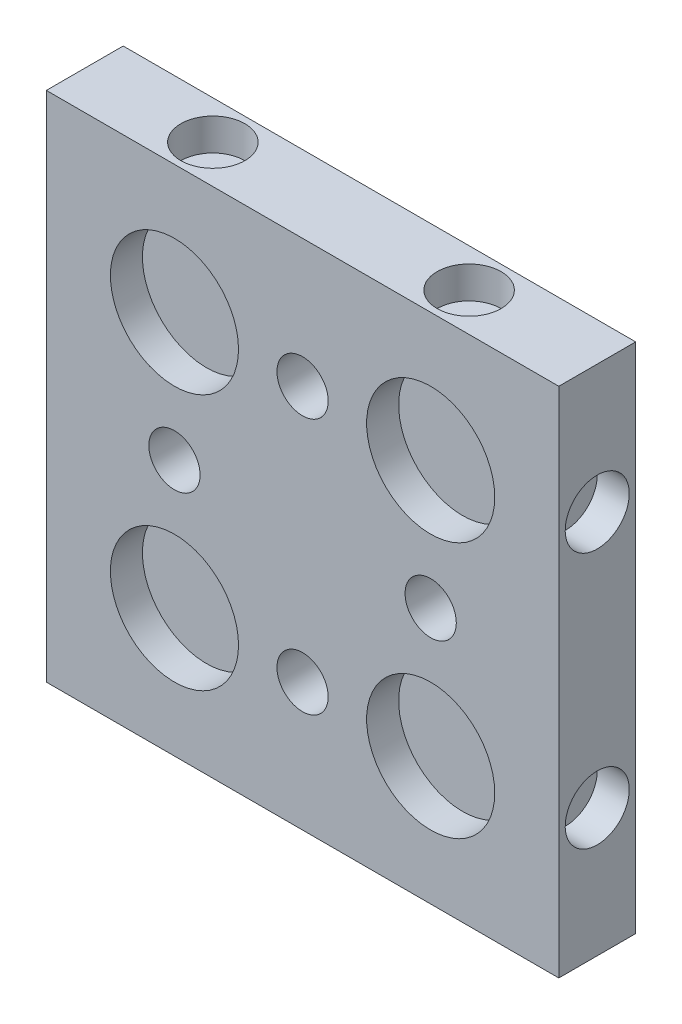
ISO-10303-21;
HEADER;
FILE_DESCRIPTION(('STEP AP214'),'2;1');
FILE_NAME('part.step','',(''),(''),'','','');
FILE_SCHEMA(('AUTOMOTIVE_DESIGN { 1 0 10303 214 1 1 1 1 }'));
ENDSEC;
DATA;
#1=APPLICATION_CONTEXT('core data for automotive mechanical design processes');
#2=APPLICATION_PROTOCOL_DEFINITION('international standard','automotive_design',2000,#1);
#3=PRODUCT_CONTEXT('',#1,'mechanical');
#4=PRODUCT('Part','Part','',(#3));
#5=PRODUCT_RELATED_PRODUCT_CATEGORY('part','',(#4));
#6=PRODUCT_DEFINITION_FORMATION('','',#4);
#7=PRODUCT_DEFINITION_CONTEXT('part definition',#1,'design');
#8=PRODUCT_DEFINITION('design','',#6,#7);
#9=PRODUCT_DEFINITION_SHAPE('','',#8);
#10=(LENGTH_UNIT() NAMED_UNIT(*) SI_UNIT(.MILLI.,.METRE.));
#11=(NAMED_UNIT(*) PLANE_ANGLE_UNIT() SI_UNIT($,.RADIAN.));
#12=(NAMED_UNIT(*) SI_UNIT($,.STERADIAN.) SOLID_ANGLE_UNIT());
#13=UNCERTAINTY_MEASURE_WITH_UNIT(LENGTH_MEASURE(1.E-05),#10,'distance_accuracy_value','');
#14=(GEOMETRIC_REPRESENTATION_CONTEXT(3) GLOBAL_UNCERTAINTY_ASSIGNED_CONTEXT((#13)) GLOBAL_UNIT_ASSIGNED_CONTEXT((#10,
#11,#12)) REPRESENTATION_CONTEXT('',''));
#15=CARTESIAN_POINT('',(0.,0.,0.));
#16=DIRECTION('',(0.,0.,1.));
#17=DIRECTION('',(1.,0.,0.));
#18=AXIS2_PLACEMENT_3D('',#15,#16,#17);
#19=CARTESIAN_POINT('',(-21.3507246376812,25.9521739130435,7.62));
#20=DIRECTION('',(1.,0.,0.));
#21=DIRECTION('',(0.,1.,0.));
#22=AXIS2_PLACEMENT_3D('',#19,#20,#21);
#23=PLANE('',#22);
#24=CARTESIAN_POINT('',(-21.3507246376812,13.2521739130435,3.81));
#25=DIRECTION('',(-1.,0.,0.));
#26=DIRECTION('',(0.,-1.,0.));
#27=AXIS2_PLACEMENT_3D('',#24,#25,#26);
#28=CIRCLE('',#27,3.175);
#29=CARTESIAN_POINT('',(-21.3507246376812,10.0771739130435,3.81));
#30=VERTEX_POINT('',#29);
#31=EDGE_CURVE('E239',#30,#30,#28,.T.);
#32=ORIENTED_EDGE('',*,*,#31,.F.);
#33=EDGE_LOOP('',(#32));
#34=FACE_BOUND('',#33,.T.);
#35=CARTESIAN_POINT('',(-21.3507246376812,-12.1478260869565,3.81));
#36=DIRECTION('',(-1.,0.,0.));
#37=DIRECTION('',(0.,-1.,0.));
#38=AXIS2_PLACEMENT_3D('',#35,#36,#37);
#39=CIRCLE('',#38,3.175);
#40=CARTESIAN_POINT('',(-21.3507246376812,-15.3228260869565,3.81));
#41=VERTEX_POINT('',#40);
#42=EDGE_CURVE('E234',#41,#41,#39,.T.);
#43=ORIENTED_EDGE('',*,*,#42,.F.);
#44=EDGE_LOOP('',(#43));
#45=FACE_BOUND('',#44,.T.);
#46=DIRECTION('',(0.,-1.,0.));
#47=VECTOR('',#46,1.);
#48=CARTESIAN_POINT('',(-21.3507246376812,25.9521739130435,0.));
#49=LINE('',#48,#47);
#50=CARTESIAN_POINT('',(-21.3507246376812,25.9521739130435,0.));
#51=VERTEX_POINT('',#50);
#52=CARTESIAN_POINT('',(-21.3507246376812,-24.8478260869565,0.));
#53=VERTEX_POINT('',#52);
#54=EDGE_CURVE('E113',#51,#53,#49,.T.);
#55=ORIENTED_EDGE('',*,*,#54,.T.);
#56=DIRECTION('',(0.,0.,-1.));
#57=VECTOR('',#56,1.);
#58=CARTESIAN_POINT('',(-21.3507246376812,-24.8478260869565,7.62));
#59=LINE('',#58,#57);
#60=CARTESIAN_POINT('',(-21.3507246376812,-24.8478260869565,7.62));
#61=VERTEX_POINT('',#60);
#62=EDGE_CURVE('E11',#61,#53,#59,.T.);
#63=ORIENTED_EDGE('',*,*,#62,.F.);
#64=DIRECTION('',(0.,-1.,0.));
#65=VECTOR('',#64,1.);
#66=CARTESIAN_POINT('',(-21.3507246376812,25.9521739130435,7.62));
#67=LINE('',#66,#65);
#68=CARTESIAN_POINT('',(-21.3507246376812,25.9521739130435,7.62));
#69=VERTEX_POINT('',#68);
#70=EDGE_CURVE('E97',#69,#61,#67,.T.);
#71=ORIENTED_EDGE('',*,*,#70,.F.);
#72=DIRECTION('',(0.,0.,-1.));
#73=VECTOR('',#72,1.);
#74=CARTESIAN_POINT('',(-21.3507246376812,25.9521739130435,7.62));
#75=LINE('',#74,#73);
#76=EDGE_CURVE('E109',#69,#51,#75,.T.);
#77=ORIENTED_EDGE('',*,*,#76,.T.);
#78=EDGE_LOOP('',(#55,#63,#71,#77));
#79=FACE_BOUND('',#78,.T.);
#80=ADVANCED_FACE('F45',(#34,#45,#79),#23,.F.);
#81=CARTESIAN_POINT('',(-21.3507246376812,-24.8478260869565,7.62));
#82=DIRECTION('',(0.,1.,0.));
#83=DIRECTION('',(0.,0.,1.));
#84=AXIS2_PLACEMENT_3D('',#81,#82,#83);
#85=PLANE('',#84);
#86=CARTESIAN_POINT('',(-8.65072463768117,-24.8478260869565,3.81));
#87=DIRECTION('',(0.,-1.,0.));
#88=DIRECTION('',(0.,0.,-1.));
#89=AXIS2_PLACEMENT_3D('',#86,#87,#88);
#90=CIRCLE('',#89,3.175);
#91=CARTESIAN_POINT('',(-8.65072463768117,-24.8478260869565,0.634999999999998));
#92=VERTEX_POINT('',#91);
#93=EDGE_CURVE('E223',#92,#92,#90,.T.);
#94=ORIENTED_EDGE('',*,*,#93,.F.);
#95=EDGE_LOOP('',(#94));
#96=FACE_BOUND('',#95,.T.);
#97=CARTESIAN_POINT('',(16.7492753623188,-24.8478260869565,3.81));
#98=DIRECTION('',(0.,-1.,0.));
#99=DIRECTION('',(0.,0.,-1.));
#100=AXIS2_PLACEMENT_3D('',#97,#98,#99);
#101=CIRCLE('',#100,3.175);
#102=CARTESIAN_POINT('',(16.7492753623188,-24.8478260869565,0.634999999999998));
#103=VERTEX_POINT('',#102);
#104=EDGE_CURVE('E218',#103,#103,#101,.T.);
#105=ORIENTED_EDGE('',*,*,#104,.F.);
#106=EDGE_LOOP('',(#105));
#107=FACE_BOUND('',#106,.T.);
#108=DIRECTION('',(1.,0.,0.));
#109=VECTOR('',#108,1.);
#110=CARTESIAN_POINT('',(-21.3507246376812,-24.8478260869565,0.));
#111=LINE('',#110,#109);
#112=CARTESIAN_POINT('',(29.4492753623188,-24.8478260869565,0.));
#113=VERTEX_POINT('',#112);
#114=EDGE_CURVE('E102',#53,#113,#111,.T.);
#115=ORIENTED_EDGE('',*,*,#114,.T.);
#116=DIRECTION('',(0.,0.,-1.));
#117=VECTOR('',#116,1.);
#118=CARTESIAN_POINT('',(29.4492753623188,-24.8478260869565,7.62));
#119=LINE('',#118,#117);
#120=CARTESIAN_POINT('',(29.4492753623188,-24.8478260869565,7.62));
#121=VERTEX_POINT('',#120);
#122=EDGE_CURVE('E54',#121,#113,#119,.T.);
#123=ORIENTED_EDGE('',*,*,#122,.F.);
#124=DIRECTION('',(1.,0.,0.));
#125=VECTOR('',#124,1.);
#126=CARTESIAN_POINT('',(-21.3507246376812,-24.8478260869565,7.62));
#127=LINE('',#126,#125);
#128=EDGE_CURVE('E92',#61,#121,#127,.T.);
#129=ORIENTED_EDGE('',*,*,#128,.F.);
#130=ORIENTED_EDGE('',*,*,#62,.T.);
#131=EDGE_LOOP('',(#115,#123,#129,#130));
#132=FACE_BOUND('',#131,.T.);
#133=ADVANCED_FACE('F101',(#96,#107,#132),#85,.F.);
#134=CARTESIAN_POINT('',(29.4492753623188,25.9521739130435,7.62));
#135=DIRECTION('',(-1.,0.,0.));
#136=DIRECTION('',(0.,-1.,0.));
#137=AXIS2_PLACEMENT_3D('',#134,#135,#136);
#138=PLANE('',#137);
#139=CARTESIAN_POINT('',(29.4492753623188,13.2521739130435,3.81));
#140=DIRECTION('',(1.,0.,0.));
#141=DIRECTION('',(0.,1.,0.));
#142=AXIS2_PLACEMENT_3D('',#139,#140,#141);
#143=CIRCLE('',#142,3.175);
#144=CARTESIAN_POINT('',(29.4492753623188,16.4271739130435,3.81));
#145=VERTEX_POINT('',#144);
#146=EDGE_CURVE('E207',#145,#145,#143,.T.);
#147=ORIENTED_EDGE('',*,*,#146,.F.);
#148=EDGE_LOOP('',(#147));
#149=FACE_BOUND('',#148,.T.);
#150=CARTESIAN_POINT('',(29.4492753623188,-12.1478260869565,3.81));
#151=DIRECTION('',(1.,0.,0.));
#152=DIRECTION('',(0.,1.,0.));
#153=AXIS2_PLACEMENT_3D('',#150,#151,#152);
#154=CIRCLE('',#153,3.175);
#155=CARTESIAN_POINT('',(29.4492753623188,-8.97282608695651,3.81));
#156=VERTEX_POINT('',#155);
#157=EDGE_CURVE('E202',#156,#156,#154,.T.);
#158=ORIENTED_EDGE('',*,*,#157,.F.);
#159=EDGE_LOOP('',(#158));
#160=FACE_BOUND('',#159,.T.);
#161=DIRECTION('',(0.,1.,0.));
#162=VECTOR('',#161,1.);
#163=CARTESIAN_POINT('',(29.4492753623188,25.9521739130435,0.));
#164=LINE('',#163,#162);
#165=CARTESIAN_POINT('',(29.4492753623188,25.9521739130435,0.));
#166=VERTEX_POINT('',#165);
#167=EDGE_CURVE('E79',#113,#166,#164,.T.);
#168=ORIENTED_EDGE('',*,*,#167,.T.);
#169=DIRECTION('',(0.,0.,-1.));
#170=VECTOR('',#169,1.);
#171=CARTESIAN_POINT('',(29.4492753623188,25.9521739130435,7.62));
#172=LINE('',#171,#170);
#173=CARTESIAN_POINT('',(29.4492753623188,25.9521739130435,7.62));
#174=VERTEX_POINT('',#173);
#175=EDGE_CURVE('E104',#174,#166,#172,.T.);
#176=ORIENTED_EDGE('',*,*,#175,.F.);
#177=DIRECTION('',(0.,1.,0.));
#178=VECTOR('',#177,1.);
#179=CARTESIAN_POINT('',(29.4492753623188,25.9521739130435,7.62));
#180=LINE('',#179,#178);
#181=EDGE_CURVE('E95',#121,#174,#180,.T.);
#182=ORIENTED_EDGE('',*,*,#181,.F.);
#183=ORIENTED_EDGE('',*,*,#122,.T.);
#184=EDGE_LOOP('',(#168,#176,#182,#183));
#185=FACE_BOUND('',#184,.T.);
#186=ADVANCED_FACE('F105',(#149,#160,#185),#138,.F.);
#187=CARTESIAN_POINT('',(-21.3507246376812,25.9521739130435,7.62));
#188=DIRECTION('',(0.,-1.,0.));
#189=DIRECTION('',(0.,0.,-1.));
#190=AXIS2_PLACEMENT_3D('',#187,#188,#189);
#191=PLANE('',#190);
#192=CARTESIAN_POINT('',(-8.65072463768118,25.9521739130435,3.81));
#193=DIRECTION('',(0.,1.,0.));
#194=DIRECTION('',(0.,0.,1.));
#195=AXIS2_PLACEMENT_3D('',#192,#193,#194);
#196=CIRCLE('',#195,3.175);
#197=CARTESIAN_POINT('',(-8.65072463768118,25.9521739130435,6.985));
#198=VERTEX_POINT('',#197);
#199=EDGE_CURVE('E254',#198,#198,#196,.T.);
#200=ORIENTED_EDGE('',*,*,#199,.F.);
#201=EDGE_LOOP('',(#200));
#202=FACE_BOUND('',#201,.T.);
#203=CARTESIAN_POINT('',(16.7492753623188,25.9521739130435,3.81));
#204=DIRECTION('',(0.,1.,0.));
#205=DIRECTION('',(0.,0.,1.));
#206=AXIS2_PLACEMENT_3D('',#203,#204,#205);
#207=CIRCLE('',#206,3.175);
#208=CARTESIAN_POINT('',(16.7492753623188,25.9521739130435,6.985));
#209=VERTEX_POINT('',#208);
#210=EDGE_CURVE('E250',#209,#209,#207,.T.);
#211=ORIENTED_EDGE('',*,*,#210,.F.);
#212=EDGE_LOOP('',(#211));
#213=FACE_BOUND('',#212,.T.);
#214=DIRECTION('',(-1.,0.,0.));
#215=VECTOR('',#214,1.);
#216=CARTESIAN_POINT('',(-21.3507246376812,25.9521739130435,0.));
#217=LINE('',#216,#215);
#218=EDGE_CURVE('E85',#166,#51,#217,.T.);
#219=ORIENTED_EDGE('',*,*,#218,.T.);
#220=ORIENTED_EDGE('',*,*,#76,.F.);
#221=DIRECTION('',(-1.,0.,0.));
#222=VECTOR('',#221,1.);
#223=CARTESIAN_POINT('',(-21.3507246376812,25.9521739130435,7.62));
#224=LINE('',#223,#222);
#225=EDGE_CURVE('E62',#174,#69,#224,.T.);
#226=ORIENTED_EDGE('',*,*,#225,.F.);
#227=ORIENTED_EDGE('',*,*,#175,.T.);
#228=EDGE_LOOP('',(#219,#220,#226,#227));
#229=FACE_BOUND('',#228,.T.);
#230=ADVANCED_FACE('F127',(#202,#213,#229),#191,.F.);
#231=CARTESIAN_POINT('',(0.,0.,7.62));
#232=DIRECTION('',(0.,0.,1.));
#233=DIRECTION('',(1.,0.,0.));
#234=AXIS2_PLACEMENT_3D('',#231,#232,#233);
#235=PLANE('',#234);
#236=CARTESIAN_POINT('',(-8.65072463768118,-12.1478260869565,7.62));
#237=DIRECTION('',(0.,0.,1.));
#238=DIRECTION('',(1.,0.,0.));
#239=AXIS2_PLACEMENT_3D('',#236,#237,#238);
#240=CIRCLE('',#239,6.35);
#241=CARTESIAN_POINT('',(-2.30072463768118,-12.1478260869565,7.62));
#242=VERTEX_POINT('',#241);
#243=EDGE_CURVE('E178',#242,#242,#240,.T.);
#244=ORIENTED_EDGE('',*,*,#243,.F.);
#245=EDGE_LOOP('',(#244));
#246=FACE_BOUND('',#245,.T.);
#247=CARTESIAN_POINT('',(16.7492753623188,-12.1478260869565,7.62));
#248=DIRECTION('',(0.,0.,1.));
#249=DIRECTION('',(1.,0.,0.));
#250=AXIS2_PLACEMENT_3D('',#247,#248,#249);
#251=CIRCLE('',#250,6.35);
#252=CARTESIAN_POINT('',(23.0992753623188,-12.1478260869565,7.62));
#253=VERTEX_POINT('',#252);
#254=EDGE_CURVE('E187',#253,#253,#251,.T.);
#255=ORIENTED_EDGE('',*,*,#254,.F.);
#256=EDGE_LOOP('',(#255));
#257=FACE_BOUND('',#256,.T.);
#258=CARTESIAN_POINT('',(16.7492753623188,13.2521739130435,7.62));
#259=DIRECTION('',(0.,0.,1.));
#260=DIRECTION('',(1.,0.,0.));
#261=AXIS2_PLACEMENT_3D('',#258,#259,#260);
#262=CIRCLE('',#261,6.35);
#263=CARTESIAN_POINT('',(23.0992753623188,13.2521739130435,7.62));
#264=VERTEX_POINT('',#263);
#265=EDGE_CURVE('E170',#264,#264,#262,.T.);
#266=ORIENTED_EDGE('',*,*,#265,.F.);
#267=EDGE_LOOP('',(#266));
#268=FACE_BOUND('',#267,.T.);
#269=CARTESIAN_POINT('',(-8.65072463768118,13.2521739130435,7.62));
#270=DIRECTION('',(0.,0.,1.));
#271=DIRECTION('',(1.,0.,0.));
#272=AXIS2_PLACEMENT_3D('',#269,#270,#271);
#273=CIRCLE('',#272,6.35);
#274=CARTESIAN_POINT('',(-2.30072463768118,13.2521739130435,7.62));
#275=VERTEX_POINT('',#274);
#276=EDGE_CURVE('E166',#275,#275,#273,.T.);
#277=ORIENTED_EDGE('',*,*,#276,.F.);
#278=EDGE_LOOP('',(#277));
#279=FACE_BOUND('',#278,.T.);
#280=CARTESIAN_POINT('',(-8.65072463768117,0.552173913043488,7.62));
#281=DIRECTION('',(0.,0.,1.));
#282=DIRECTION('',(1.,0.,0.));
#283=AXIS2_PLACEMENT_3D('',#280,#281,#282);
#284=CIRCLE('',#283,2.54);
#285=CARTESIAN_POINT('',(-6.11072463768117,0.552173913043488,7.62));
#286=VERTEX_POINT('',#285);
#287=EDGE_CURVE('E159',#286,#286,#284,.T.);
#288=ORIENTED_EDGE('',*,*,#287,.F.);
#289=EDGE_LOOP('',(#288));
#290=FACE_BOUND('',#289,.T.);
#291=CARTESIAN_POINT('',(4.04927536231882,13.2521739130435,7.62));
#292=DIRECTION('',(0.,0.,1.));
#293=DIRECTION('',(1.,0.,0.));
#294=AXIS2_PLACEMENT_3D('',#291,#292,#293);
#295=CIRCLE('',#294,2.54);
#296=CARTESIAN_POINT('',(6.58927536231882,13.2521739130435,7.62));
#297=VERTEX_POINT('',#296);
#298=EDGE_CURVE('E155',#297,#297,#295,.T.);
#299=ORIENTED_EDGE('',*,*,#298,.F.);
#300=EDGE_LOOP('',(#299));
#301=FACE_BOUND('',#300,.T.);
#302=CARTESIAN_POINT('',(4.04927536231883,-12.1478260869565,7.62));
#303=DIRECTION('',(0.,0.,1.));
#304=DIRECTION('',(1.,0.,0.));
#305=AXIS2_PLACEMENT_3D('',#302,#303,#304);
#306=CIRCLE('',#305,2.54);
#307=CARTESIAN_POINT('',(6.58927536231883,-12.1478260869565,7.62));
#308=VERTEX_POINT('',#307);
#309=EDGE_CURVE('E147',#308,#308,#306,.T.);
#310=ORIENTED_EDGE('',*,*,#309,.F.);
#311=EDGE_LOOP('',(#310));
#312=FACE_BOUND('',#311,.T.);
#313=CARTESIAN_POINT('',(16.7492753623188,0.552173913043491,7.62));
#314=DIRECTION('',(0.,0.,1.));
#315=DIRECTION('',(1.,0.,0.));
#316=AXIS2_PLACEMENT_3D('',#313,#314,#315);
#317=CIRCLE('',#316,2.54);
#318=CARTESIAN_POINT('',(19.2892753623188,0.552173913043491,7.62));
#319=VERTEX_POINT('',#318);
#320=EDGE_CURVE('E138',#319,#319,#317,.T.);
#321=ORIENTED_EDGE('',*,*,#320,.F.);
#322=EDGE_LOOP('',(#321));
#323=FACE_BOUND('',#322,.T.);
#324=ORIENTED_EDGE('',*,*,#70,.T.);
#325=ORIENTED_EDGE('',*,*,#128,.T.);
#326=ORIENTED_EDGE('',*,*,#181,.T.);
#327=ORIENTED_EDGE('',*,*,#225,.T.);
#328=EDGE_LOOP('',(#324,#325,#326,#327));
#329=FACE_BOUND('',#328,.T.);
#330=ADVANCED_FACE('F93',(#246,#257,#268,#279,#290,#301,#312,#323,#329),#235,.T.);
#331=CARTESIAN_POINT('',(0.,0.,0.));
#332=DIRECTION('',(0.,0.,1.));
#333=DIRECTION('',(1.,0.,0.));
#334=AXIS2_PLACEMENT_3D('',#331,#332,#333);
#335=PLANE('',#334);
#336=CARTESIAN_POINT('',(-8.65072463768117,0.552173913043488,0.));
#337=DIRECTION('',(0.,0.,1.));
#338=DIRECTION('',(1.,0.,0.));
#339=AXIS2_PLACEMENT_3D('',#336,#337,#338);
#340=CIRCLE('',#339,2.54);
#341=CARTESIAN_POINT('',(-6.11072463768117,0.552173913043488,0.));
#342=VERTEX_POINT('',#341);
#343=EDGE_CURVE('E117',#342,#342,#340,.T.);
#344=ORIENTED_EDGE('',*,*,#343,.T.);
#345=EDGE_LOOP('',(#344));
#346=FACE_BOUND('',#345,.T.);
#347=CARTESIAN_POINT('',(4.04927536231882,13.2521739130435,0.));
#348=DIRECTION('',(0.,0.,1.));
#349=DIRECTION('',(1.,0.,0.));
#350=AXIS2_PLACEMENT_3D('',#347,#348,#349);
#351=CIRCLE('',#350,2.54);
#352=CARTESIAN_POINT('',(6.58927536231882,13.2521739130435,0.));
#353=VERTEX_POINT('',#352);
#354=EDGE_CURVE('E151',#353,#353,#351,.T.);
#355=ORIENTED_EDGE('',*,*,#354,.T.);
#356=EDGE_LOOP('',(#355));
#357=FACE_BOUND('',#356,.T.);
#358=CARTESIAN_POINT('',(4.04927536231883,-12.1478260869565,0.));
#359=DIRECTION('',(0.,0.,1.));
#360=DIRECTION('',(1.,0.,0.));
#361=AXIS2_PLACEMENT_3D('',#358,#359,#360);
#362=CIRCLE('',#361,2.54);
#363=CARTESIAN_POINT('',(6.58927536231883,-12.1478260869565,0.));
#364=VERTEX_POINT('',#363);
#365=EDGE_CURVE('E143',#364,#364,#362,.T.);
#366=ORIENTED_EDGE('',*,*,#365,.T.);
#367=EDGE_LOOP('',(#366));
#368=FACE_BOUND('',#367,.T.);
#369=CARTESIAN_POINT('',(16.7492753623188,0.552173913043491,0.));
#370=DIRECTION('',(0.,0.,1.));
#371=DIRECTION('',(1.,0.,0.));
#372=AXIS2_PLACEMENT_3D('',#369,#370,#371);
#373=CIRCLE('',#372,2.54);
#374=CARTESIAN_POINT('',(19.2892753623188,0.552173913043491,0.));
#375=VERTEX_POINT('',#374);
#376=EDGE_CURVE('E134',#375,#375,#373,.T.);
#377=ORIENTED_EDGE('',*,*,#376,.T.);
#378=EDGE_LOOP('',(#377));
#379=FACE_BOUND('',#378,.T.);
#380=ORIENTED_EDGE('',*,*,#54,.F.);
#381=ORIENTED_EDGE('',*,*,#218,.F.);
#382=ORIENTED_EDGE('',*,*,#167,.F.);
#383=ORIENTED_EDGE('',*,*,#114,.F.);
#384=EDGE_LOOP('',(#380,#381,#382,#383));
#385=FACE_BOUND('',#384,.T.);
#386=ADVANCED_FACE('F130',(#346,#357,#368,#379,#385),#335,.F.);
#387=CARTESIAN_POINT('',(16.7492753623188,0.552173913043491,0.));
#388=DIRECTION('',(0.,0.,1.));
#389=DIRECTION('',(1.,0.,0.));
#390=AXIS2_PLACEMENT_3D('',#387,#388,#389);
#391=CYLINDRICAL_SURFACE('',#390,2.54);
#392=CARTESIAN_POINT('',(19.2892753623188,0.552173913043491,0.));
#393=CARTESIAN_POINT('',(19.2892753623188,0.552173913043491,0.0793749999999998));
#394=CARTESIAN_POINT('',(19.2892753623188,0.552173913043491,0.15875));
#395=CARTESIAN_POINT('',(19.2892753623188,0.552173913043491,0.3175));
#396=CARTESIAN_POINT('',(19.2892753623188,0.552173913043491,0.396875));
#397=CARTESIAN_POINT('',(19.2892753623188,0.552173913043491,0.555625));
#398=CARTESIAN_POINT('',(19.2892753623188,0.552173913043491,0.635));
#399=CARTESIAN_POINT('',(19.2892753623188,0.552173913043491,0.79375));
#400=CARTESIAN_POINT('',(19.2892753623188,0.552173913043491,0.873125));
#401=CARTESIAN_POINT('',(19.2892753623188,0.552173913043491,1.031875));
#402=CARTESIAN_POINT('',(19.2892753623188,0.552173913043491,1.11125));
#403=CARTESIAN_POINT('',(19.2892753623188,0.552173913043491,1.27));
#404=CARTESIAN_POINT('',(19.2892753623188,0.552173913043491,1.349375));
#405=CARTESIAN_POINT('',(19.2892753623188,0.552173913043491,1.508125));
#406=CARTESIAN_POINT('',(19.2892753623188,0.552173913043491,1.5875));
#407=CARTESIAN_POINT('',(19.2892753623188,0.552173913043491,1.74625));
#408=CARTESIAN_POINT('',(19.2892753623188,0.552173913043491,1.825625));
#409=CARTESIAN_POINT('',(19.2892753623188,0.552173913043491,1.984375));
#410=CARTESIAN_POINT('',(19.2892753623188,0.552173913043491,2.06375));
#411=CARTESIAN_POINT('',(19.2892753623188,0.552173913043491,2.2225));
#412=CARTESIAN_POINT('',(19.2892753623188,0.552173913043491,2.301875));
#413=CARTESIAN_POINT('',(19.2892753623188,0.552173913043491,2.460625));
#414=CARTESIAN_POINT('',(19.2892753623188,0.552173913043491,2.54));
#415=CARTESIAN_POINT('',(19.2892753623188,0.552173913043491,2.69875));
#416=CARTESIAN_POINT('',(19.2892753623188,0.552173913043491,2.778125));
#417=CARTESIAN_POINT('',(19.2892753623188,0.552173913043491,2.936875));
#418=CARTESIAN_POINT('',(19.2892753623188,0.552173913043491,3.01625));
#419=CARTESIAN_POINT('',(19.2892753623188,0.552173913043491,3.175));
#420=CARTESIAN_POINT('',(19.2892753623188,0.552173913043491,3.254375));
#421=CARTESIAN_POINT('',(19.2892753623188,0.552173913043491,3.413125));
#422=CARTESIAN_POINT('',(19.2892753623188,0.552173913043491,3.4925));
#423=CARTESIAN_POINT('',(19.2892753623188,0.552173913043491,3.65125));
#424=CARTESIAN_POINT('',(19.2892753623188,0.552173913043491,3.730625));
#425=CARTESIAN_POINT('',(19.2892753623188,0.552173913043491,3.889375));
#426=CARTESIAN_POINT('',(19.2892753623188,0.552173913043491,3.96875));
#427=CARTESIAN_POINT('',(19.2892753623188,0.552173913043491,4.1275));
#428=CARTESIAN_POINT('',(19.2892753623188,0.552173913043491,4.206875));
#429=CARTESIAN_POINT('',(19.2892753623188,0.552173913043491,4.365625));
#430=CARTESIAN_POINT('',(19.2892753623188,0.552173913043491,4.445));
#431=CARTESIAN_POINT('',(19.2892753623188,0.552173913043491,4.60375));
#432=CARTESIAN_POINT('',(19.2892753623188,0.552173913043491,4.683125));
#433=CARTESIAN_POINT('',(19.2892753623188,0.552173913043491,4.841875));
#434=CARTESIAN_POINT('',(19.2892753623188,0.552173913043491,4.92125));
#435=CARTESIAN_POINT('',(19.2892753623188,0.552173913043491,5.08));
#436=CARTESIAN_POINT('',(19.2892753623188,0.552173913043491,5.159375));
#437=CARTESIAN_POINT('',(19.2892753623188,0.552173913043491,5.318125));
#438=CARTESIAN_POINT('',(19.2892753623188,0.552173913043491,5.3975));
#439=CARTESIAN_POINT('',(19.2892753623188,0.552173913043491,5.55625));
#440=CARTESIAN_POINT('',(19.2892753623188,0.552173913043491,5.635625));
#441=CARTESIAN_POINT('',(19.2892753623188,0.552173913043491,5.794375));
#442=CARTESIAN_POINT('',(19.2892753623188,0.552173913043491,5.87375));
#443=CARTESIAN_POINT('',(19.2892753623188,0.552173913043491,6.0325));
#444=CARTESIAN_POINT('',(19.2892753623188,0.552173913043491,6.111875));
#445=CARTESIAN_POINT('',(19.2892753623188,0.552173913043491,6.270625));
#446=CARTESIAN_POINT('',(19.2892753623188,0.552173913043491,6.35));
#447=CARTESIAN_POINT('',(19.2892753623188,0.552173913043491,6.50875));
#448=CARTESIAN_POINT('',(19.2892753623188,0.552173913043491,6.588125));
#449=CARTESIAN_POINT('',(19.2892753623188,0.552173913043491,6.746875));
#450=CARTESIAN_POINT('',(19.2892753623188,0.552173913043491,6.82625));
#451=CARTESIAN_POINT('',(19.2892753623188,0.552173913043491,6.985));
#452=CARTESIAN_POINT('',(19.2892753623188,0.552173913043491,7.064375));
#453=CARTESIAN_POINT('',(19.2892753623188,0.552173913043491,7.223125));
#454=CARTESIAN_POINT('',(19.2892753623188,0.552173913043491,7.3025));
#455=CARTESIAN_POINT('',(19.2892753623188,0.552173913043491,7.46125));
#456=CARTESIAN_POINT('',(19.2892753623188,0.552173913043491,7.540625));
#457=CARTESIAN_POINT('',(19.2892753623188,0.552173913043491,7.62));
#458=B_SPLINE_CURVE_WITH_KNOTS('',3,(#392,#393,#394,#395,#396,#397,#398,#399,#400,#401,#402,
#403,#404,#405,#406,#407,#408,#409,#410,#411,#412,#413,#414,#415,#416,#417,#418,#419,#420,#421,
#422,#423,#424,#425,#426,#427,#428,#429,#430,#431,#432,#433,#434,#435,#436,#437,#438,#439,#440,
#441,#442,#443,#444,#445,#446,#447,#448,#449,#450,#451,#452,#453,#454,#455,#456,#457),
.UNSPECIFIED.,.F.,.F.,(4,2,2,2,2,2,2,2,2,2,2,2,2,2,2,2,2,2,2,2,2,2,2,2,2,2,2,2,2,2,2,2,4),(0.,
0.238125,0.47625,0.714375,0.9525,1.190625,1.42875,1.666875,1.905,2.143125,2.38125,2.619375,
2.8575,3.095625,3.33375,3.571875,3.81,4.048125,4.28625,4.524375,4.7625,5.000625,5.23875,
5.476875,5.715,5.953125,6.19125,6.429375,6.6675,6.905625,7.14375,7.381875,7.62),.UNSPECIFIED.);
#459=EDGE_CURVE('BSEAM389',#375,#319,#458,.T.);
#460=ORIENTED_EDGE('',*,*,#376,.F.);
#461=ORIENTED_EDGE('',*,*,#320,.T.);
#462=ORIENTED_EDGE('',*,*,#459,.T.);
#463=ORIENTED_EDGE('',*,*,#459,.F.);
#464=EDGE_LOOP('',(#460,#462,#461,#463));
#465=FACE_BOUND('',#464,.T.);
#466=ADVANCED_FACE('F389',(#465),#391,.F.);
#467=CARTESIAN_POINT('',(4.04927536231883,-12.1478260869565,0.));
#468=DIRECTION('',(0.,0.,1.));
#469=DIRECTION('',(1.,0.,0.));
#470=AXIS2_PLACEMENT_3D('',#467,#468,#469);
#471=CYLINDRICAL_SURFACE('',#470,2.54);
#472=CARTESIAN_POINT('',(6.58927536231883,-12.1478260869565,0.));
#473=CARTESIAN_POINT('',(6.58927536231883,-12.1478260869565,0.0793749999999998));
#474=CARTESIAN_POINT('',(6.58927536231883,-12.1478260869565,0.15875));
#475=CARTESIAN_POINT('',(6.58927536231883,-12.1478260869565,0.3175));
#476=CARTESIAN_POINT('',(6.58927536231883,-12.1478260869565,0.396875));
#477=CARTESIAN_POINT('',(6.58927536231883,-12.1478260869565,0.555625));
#478=CARTESIAN_POINT('',(6.58927536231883,-12.1478260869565,0.635));
#479=CARTESIAN_POINT('',(6.58927536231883,-12.1478260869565,0.79375));
#480=CARTESIAN_POINT('',(6.58927536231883,-12.1478260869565,0.873125));
#481=CARTESIAN_POINT('',(6.58927536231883,-12.1478260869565,1.031875));
#482=CARTESIAN_POINT('',(6.58927536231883,-12.1478260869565,1.11125));
#483=CARTESIAN_POINT('',(6.58927536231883,-12.1478260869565,1.27));
#484=CARTESIAN_POINT('',(6.58927536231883,-12.1478260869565,1.349375));
#485=CARTESIAN_POINT('',(6.58927536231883,-12.1478260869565,1.508125));
#486=CARTESIAN_POINT('',(6.58927536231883,-12.1478260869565,1.5875));
#487=CARTESIAN_POINT('',(6.58927536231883,-12.1478260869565,1.74625));
#488=CARTESIAN_POINT('',(6.58927536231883,-12.1478260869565,1.825625));
#489=CARTESIAN_POINT('',(6.58927536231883,-12.1478260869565,1.984375));
#490=CARTESIAN_POINT('',(6.58927536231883,-12.1478260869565,2.06375));
#491=CARTESIAN_POINT('',(6.58927536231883,-12.1478260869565,2.2225));
#492=CARTESIAN_POINT('',(6.58927536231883,-12.1478260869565,2.301875));
#493=CARTESIAN_POINT('',(6.58927536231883,-12.1478260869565,2.460625));
#494=CARTESIAN_POINT('',(6.58927536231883,-12.1478260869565,2.54));
#495=CARTESIAN_POINT('',(6.58927536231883,-12.1478260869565,2.69875));
#496=CARTESIAN_POINT('',(6.58927536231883,-12.1478260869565,2.778125));
#497=CARTESIAN_POINT('',(6.58927536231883,-12.1478260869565,2.936875));
#498=CARTESIAN_POINT('',(6.58927536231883,-12.1478260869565,3.01625));
#499=CARTESIAN_POINT('',(6.58927536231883,-12.1478260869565,3.175));
#500=CARTESIAN_POINT('',(6.58927536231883,-12.1478260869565,3.254375));
#501=CARTESIAN_POINT('',(6.58927536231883,-12.1478260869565,3.413125));
#502=CARTESIAN_POINT('',(6.58927536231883,-12.1478260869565,3.4925));
#503=CARTESIAN_POINT('',(6.58927536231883,-12.1478260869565,3.65125));
#504=CARTESIAN_POINT('',(6.58927536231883,-12.1478260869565,3.730625));
#505=CARTESIAN_POINT('',(6.58927536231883,-12.1478260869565,3.889375));
#506=CARTESIAN_POINT('',(6.58927536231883,-12.1478260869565,3.96875));
#507=CARTESIAN_POINT('',(6.58927536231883,-12.1478260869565,4.1275));
#508=CARTESIAN_POINT('',(6.58927536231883,-12.1478260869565,4.206875));
#509=CARTESIAN_POINT('',(6.58927536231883,-12.1478260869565,4.365625));
#510=CARTESIAN_POINT('',(6.58927536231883,-12.1478260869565,4.445));
#511=CARTESIAN_POINT('',(6.58927536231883,-12.1478260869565,4.60375));
#512=CARTESIAN_POINT('',(6.58927536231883,-12.1478260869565,4.683125));
#513=CARTESIAN_POINT('',(6.58927536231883,-12.1478260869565,4.841875));
#514=CARTESIAN_POINT('',(6.58927536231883,-12.1478260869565,4.92125));
#515=CARTESIAN_POINT('',(6.58927536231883,-12.1478260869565,5.08));
#516=CARTESIAN_POINT('',(6.58927536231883,-12.1478260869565,5.159375));
#517=CARTESIAN_POINT('',(6.58927536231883,-12.1478260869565,5.318125));
#518=CARTESIAN_POINT('',(6.58927536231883,-12.1478260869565,5.3975));
#519=CARTESIAN_POINT('',(6.58927536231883,-12.1478260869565,5.55625));
#520=CARTESIAN_POINT('',(6.58927536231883,-12.1478260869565,5.635625));
#521=CARTESIAN_POINT('',(6.58927536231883,-12.1478260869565,5.794375));
#522=CARTESIAN_POINT('',(6.58927536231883,-12.1478260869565,5.87375));
#523=CARTESIAN_POINT('',(6.58927536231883,-12.1478260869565,6.0325));
#524=CARTESIAN_POINT('',(6.58927536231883,-12.1478260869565,6.111875));
#525=CARTESIAN_POINT('',(6.58927536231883,-12.1478260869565,6.270625));
#526=CARTESIAN_POINT('',(6.58927536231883,-12.1478260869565,6.35));
#527=CARTESIAN_POINT('',(6.58927536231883,-12.1478260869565,6.50875));
#528=CARTESIAN_POINT('',(6.58927536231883,-12.1478260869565,6.588125));
#529=CARTESIAN_POINT('',(6.58927536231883,-12.1478260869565,6.746875));
#530=CARTESIAN_POINT('',(6.58927536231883,-12.1478260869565,6.82625));
#531=CARTESIAN_POINT('',(6.58927536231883,-12.1478260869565,6.985));
#532=CARTESIAN_POINT('',(6.58927536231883,-12.1478260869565,7.064375));
#533=CARTESIAN_POINT('',(6.58927536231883,-12.1478260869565,7.223125));
#534=CARTESIAN_POINT('',(6.58927536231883,-12.1478260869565,7.3025));
#535=CARTESIAN_POINT('',(6.58927536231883,-12.1478260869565,7.46125));
#536=CARTESIAN_POINT('',(6.58927536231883,-12.1478260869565,7.540625));
#537=CARTESIAN_POINT('',(6.58927536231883,-12.1478260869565,7.62));
#538=B_SPLINE_CURVE_WITH_KNOTS('',3,(#472,#473,#474,#475,#476,#477,#478,#479,#480,#481,#482,
#483,#484,#485,#486,#487,#488,#489,#490,#491,#492,#493,#494,#495,#496,#497,#498,#499,#500,#501,
#502,#503,#504,#505,#506,#507,#508,#509,#510,#511,#512,#513,#514,#515,#516,#517,#518,#519,#520,
#521,#522,#523,#524,#525,#526,#527,#528,#529,#530,#531,#532,#533,#534,#535,#536,#537),
.UNSPECIFIED.,.F.,.F.,(4,2,2,2,2,2,2,2,2,2,2,2,2,2,2,2,2,2,2,2,2,2,2,2,2,2,2,2,2,2,2,2,4),(0.,
0.238125,0.47625,0.714375,0.9525,1.190625,1.42875,1.666875,1.905,2.143125,2.38125,2.619375,
2.8575,3.095625,3.33375,3.571875,3.81,4.048125,4.28625,4.524375,4.7625,5.000625,5.23875,
5.476875,5.715,5.953125,6.19125,6.429375,6.6675,6.905625,7.14375,7.381875,7.62),.UNSPECIFIED.);
#539=EDGE_CURVE('BSEAM385',#364,#308,#538,.T.);
#540=ORIENTED_EDGE('',*,*,#365,.F.);
#541=ORIENTED_EDGE('',*,*,#309,.T.);
#542=ORIENTED_EDGE('',*,*,#539,.T.);
#543=ORIENTED_EDGE('',*,*,#539,.F.);
#544=EDGE_LOOP('',(#540,#542,#541,#543));
#545=FACE_BOUND('',#544,.T.);
#546=ADVANCED_FACE('F385',(#545),#471,.F.);
#547=CARTESIAN_POINT('',(4.04927536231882,13.2521739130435,0.));
#548=DIRECTION('',(0.,0.,1.));
#549=DIRECTION('',(1.,0.,0.));
#550=AXIS2_PLACEMENT_3D('',#547,#548,#549);
#551=CYLINDRICAL_SURFACE('',#550,2.54);
#552=CARTESIAN_POINT('',(6.58927536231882,13.2521739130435,0.));
#553=CARTESIAN_POINT('',(6.58927536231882,13.2521739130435,0.0793749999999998));
#554=CARTESIAN_POINT('',(6.58927536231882,13.2521739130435,0.15875));
#555=CARTESIAN_POINT('',(6.58927536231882,13.2521739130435,0.3175));
#556=CARTESIAN_POINT('',(6.58927536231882,13.2521739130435,0.396875));
#557=CARTESIAN_POINT('',(6.58927536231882,13.2521739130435,0.555625));
#558=CARTESIAN_POINT('',(6.58927536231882,13.2521739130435,0.635));
#559=CARTESIAN_POINT('',(6.58927536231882,13.2521739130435,0.79375));
#560=CARTESIAN_POINT('',(6.58927536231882,13.2521739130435,0.873125));
#561=CARTESIAN_POINT('',(6.58927536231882,13.2521739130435,1.031875));
#562=CARTESIAN_POINT('',(6.58927536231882,13.2521739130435,1.11125));
#563=CARTESIAN_POINT('',(6.58927536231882,13.2521739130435,1.27));
#564=CARTESIAN_POINT('',(6.58927536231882,13.2521739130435,1.349375));
#565=CARTESIAN_POINT('',(6.58927536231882,13.2521739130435,1.508125));
#566=CARTESIAN_POINT('',(6.58927536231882,13.2521739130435,1.5875));
#567=CARTESIAN_POINT('',(6.58927536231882,13.2521739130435,1.74625));
#568=CARTESIAN_POINT('',(6.58927536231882,13.2521739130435,1.825625));
#569=CARTESIAN_POINT('',(6.58927536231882,13.2521739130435,1.984375));
#570=CARTESIAN_POINT('',(6.58927536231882,13.2521739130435,2.06375));
#571=CARTESIAN_POINT('',(6.58927536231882,13.2521739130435,2.2225));
#572=CARTESIAN_POINT('',(6.58927536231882,13.2521739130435,2.301875));
#573=CARTESIAN_POINT('',(6.58927536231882,13.2521739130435,2.460625));
#574=CARTESIAN_POINT('',(6.58927536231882,13.2521739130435,2.54));
#575=CARTESIAN_POINT('',(6.58927536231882,13.2521739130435,2.69875));
#576=CARTESIAN_POINT('',(6.58927536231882,13.2521739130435,2.778125));
#577=CARTESIAN_POINT('',(6.58927536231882,13.2521739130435,2.936875));
#578=CARTESIAN_POINT('',(6.58927536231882,13.2521739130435,3.01625));
#579=CARTESIAN_POINT('',(6.58927536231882,13.2521739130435,3.175));
#580=CARTESIAN_POINT('',(6.58927536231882,13.2521739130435,3.254375));
#581=CARTESIAN_POINT('',(6.58927536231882,13.2521739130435,3.413125));
#582=CARTESIAN_POINT('',(6.58927536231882,13.2521739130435,3.4925));
#583=CARTESIAN_POINT('',(6.58927536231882,13.2521739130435,3.65125));
#584=CARTESIAN_POINT('',(6.58927536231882,13.2521739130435,3.730625));
#585=CARTESIAN_POINT('',(6.58927536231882,13.2521739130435,3.889375));
#586=CARTESIAN_POINT('',(6.58927536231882,13.2521739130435,3.96875));
#587=CARTESIAN_POINT('',(6.58927536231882,13.2521739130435,4.1275));
#588=CARTESIAN_POINT('',(6.58927536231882,13.2521739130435,4.206875));
#589=CARTESIAN_POINT('',(6.58927536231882,13.2521739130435,4.365625));
#590=CARTESIAN_POINT('',(6.58927536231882,13.2521739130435,4.445));
#591=CARTESIAN_POINT('',(6.58927536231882,13.2521739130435,4.60375));
#592=CARTESIAN_POINT('',(6.58927536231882,13.2521739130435,4.683125));
#593=CARTESIAN_POINT('',(6.58927536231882,13.2521739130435,4.841875));
#594=CARTESIAN_POINT('',(6.58927536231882,13.2521739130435,4.92125));
#595=CARTESIAN_POINT('',(6.58927536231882,13.2521739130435,5.08));
#596=CARTESIAN_POINT('',(6.58927536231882,13.2521739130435,5.159375));
#597=CARTESIAN_POINT('',(6.58927536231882,13.2521739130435,5.318125));
#598=CARTESIAN_POINT('',(6.58927536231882,13.2521739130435,5.3975));
#599=CARTESIAN_POINT('',(6.58927536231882,13.2521739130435,5.55625));
#600=CARTESIAN_POINT('',(6.58927536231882,13.2521739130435,5.635625));
#601=CARTESIAN_POINT('',(6.58927536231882,13.2521739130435,5.794375));
#602=CARTESIAN_POINT('',(6.58927536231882,13.2521739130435,5.87375));
#603=CARTESIAN_POINT('',(6.58927536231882,13.2521739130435,6.0325));
#604=CARTESIAN_POINT('',(6.58927536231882,13.2521739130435,6.111875));
#605=CARTESIAN_POINT('',(6.58927536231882,13.2521739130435,6.270625));
#606=CARTESIAN_POINT('',(6.58927536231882,13.2521739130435,6.35));
#607=CARTESIAN_POINT('',(6.58927536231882,13.2521739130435,6.50875));
#608=CARTESIAN_POINT('',(6.58927536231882,13.2521739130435,6.588125));
#609=CARTESIAN_POINT('',(6.58927536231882,13.2521739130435,6.746875));
#610=CARTESIAN_POINT('',(6.58927536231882,13.2521739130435,6.82625));
#611=CARTESIAN_POINT('',(6.58927536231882,13.2521739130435,6.985));
#612=CARTESIAN_POINT('',(6.58927536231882,13.2521739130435,7.064375));
#613=CARTESIAN_POINT('',(6.58927536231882,13.2521739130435,7.223125));
#614=CARTESIAN_POINT('',(6.58927536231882,13.2521739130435,7.3025));
#615=CARTESIAN_POINT('',(6.58927536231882,13.2521739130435,7.46125));
#616=CARTESIAN_POINT('',(6.58927536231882,13.2521739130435,7.540625));
#617=CARTESIAN_POINT('',(6.58927536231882,13.2521739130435,7.62));
#618=B_SPLINE_CURVE_WITH_KNOTS('',3,(#552,#553,#554,#555,#556,#557,#558,#559,#560,#561,#562,
#563,#564,#565,#566,#567,#568,#569,#570,#571,#572,#573,#574,#575,#576,#577,#578,#579,#580,#581,
#582,#583,#584,#585,#586,#587,#588,#589,#590,#591,#592,#593,#594,#595,#596,#597,#598,#599,#600,
#601,#602,#603,#604,#605,#606,#607,#608,#609,#610,#611,#612,#613,#614,#615,#616,#617),
.UNSPECIFIED.,.F.,.F.,(4,2,2,2,2,2,2,2,2,2,2,2,2,2,2,2,2,2,2,2,2,2,2,2,2,2,2,2,2,2,2,2,4),(0.,
0.238125,0.47625,0.714375,0.9525,1.190625,1.42875,1.666875,1.905,2.143125,2.38125,2.619375,
2.8575,3.095625,3.33375,3.571875,3.81,4.048125,4.28625,4.524375,4.7625,5.000625,5.23875,
5.476875,5.715,5.953125,6.19125,6.429375,6.6675,6.905625,7.14375,7.381875,7.62),.UNSPECIFIED.);
#619=EDGE_CURVE('BSEAM381',#353,#297,#618,.T.);
#620=ORIENTED_EDGE('',*,*,#354,.F.);
#621=ORIENTED_EDGE('',*,*,#298,.T.);
#622=ORIENTED_EDGE('',*,*,#619,.T.);
#623=ORIENTED_EDGE('',*,*,#619,.F.);
#624=EDGE_LOOP('',(#620,#622,#621,#623));
#625=FACE_BOUND('',#624,.T.);
#626=ADVANCED_FACE('F381',(#625),#551,.F.);
#627=CARTESIAN_POINT('',(-8.65072463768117,0.552173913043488,0.));
#628=DIRECTION('',(0.,0.,1.));
#629=DIRECTION('',(1.,0.,0.));
#630=AXIS2_PLACEMENT_3D('',#627,#628,#629);
#631=CYLINDRICAL_SURFACE('',#630,2.54);
#632=CARTESIAN_POINT('',(-6.11072463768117,0.552173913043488,0.));
#633=CARTESIAN_POINT('',(-6.11072463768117,0.552173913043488,0.0793749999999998));
#634=CARTESIAN_POINT('',(-6.11072463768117,0.552173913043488,0.15875));
#635=CARTESIAN_POINT('',(-6.11072463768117,0.552173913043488,0.3175));
#636=CARTESIAN_POINT('',(-6.11072463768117,0.552173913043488,0.396875));
#637=CARTESIAN_POINT('',(-6.11072463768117,0.552173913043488,0.555625));
#638=CARTESIAN_POINT('',(-6.11072463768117,0.552173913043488,0.635));
#639=CARTESIAN_POINT('',(-6.11072463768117,0.552173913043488,0.79375));
#640=CARTESIAN_POINT('',(-6.11072463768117,0.552173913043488,0.873125));
#641=CARTESIAN_POINT('',(-6.11072463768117,0.552173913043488,1.031875));
#642=CARTESIAN_POINT('',(-6.11072463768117,0.552173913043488,1.11125));
#643=CARTESIAN_POINT('',(-6.11072463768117,0.552173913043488,1.27));
#644=CARTESIAN_POINT('',(-6.11072463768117,0.552173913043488,1.349375));
#645=CARTESIAN_POINT('',(-6.11072463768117,0.552173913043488,1.508125));
#646=CARTESIAN_POINT('',(-6.11072463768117,0.552173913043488,1.5875));
#647=CARTESIAN_POINT('',(-6.11072463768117,0.552173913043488,1.74625));
#648=CARTESIAN_POINT('',(-6.11072463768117,0.552173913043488,1.825625));
#649=CARTESIAN_POINT('',(-6.11072463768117,0.552173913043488,1.984375));
#650=CARTESIAN_POINT('',(-6.11072463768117,0.552173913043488,2.06375));
#651=CARTESIAN_POINT('',(-6.11072463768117,0.552173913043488,2.2225));
#652=CARTESIAN_POINT('',(-6.11072463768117,0.552173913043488,2.301875));
#653=CARTESIAN_POINT('',(-6.11072463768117,0.552173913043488,2.460625));
#654=CARTESIAN_POINT('',(-6.11072463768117,0.552173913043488,2.54));
#655=CARTESIAN_POINT('',(-6.11072463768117,0.552173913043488,2.69875));
#656=CARTESIAN_POINT('',(-6.11072463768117,0.552173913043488,2.778125));
#657=CARTESIAN_POINT('',(-6.11072463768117,0.552173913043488,2.936875));
#658=CARTESIAN_POINT('',(-6.11072463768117,0.552173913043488,3.01625));
#659=CARTESIAN_POINT('',(-6.11072463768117,0.552173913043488,3.175));
#660=CARTESIAN_POINT('',(-6.11072463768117,0.552173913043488,3.254375));
#661=CARTESIAN_POINT('',(-6.11072463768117,0.552173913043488,3.413125));
#662=CARTESIAN_POINT('',(-6.11072463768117,0.552173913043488,3.4925));
#663=CARTESIAN_POINT('',(-6.11072463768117,0.552173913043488,3.65125));
#664=CARTESIAN_POINT('',(-6.11072463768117,0.552173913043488,3.730625));
#665=CARTESIAN_POINT('',(-6.11072463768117,0.552173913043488,3.889375));
#666=CARTESIAN_POINT('',(-6.11072463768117,0.552173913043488,3.96875));
#667=CARTESIAN_POINT('',(-6.11072463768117,0.552173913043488,4.1275));
#668=CARTESIAN_POINT('',(-6.11072463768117,0.552173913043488,4.206875));
#669=CARTESIAN_POINT('',(-6.11072463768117,0.552173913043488,4.365625));
#670=CARTESIAN_POINT('',(-6.11072463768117,0.552173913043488,4.445));
#671=CARTESIAN_POINT('',(-6.11072463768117,0.552173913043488,4.60375));
#672=CARTESIAN_POINT('',(-6.11072463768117,0.552173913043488,4.683125));
#673=CARTESIAN_POINT('',(-6.11072463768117,0.552173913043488,4.841875));
#674=CARTESIAN_POINT('',(-6.11072463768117,0.552173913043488,4.92125));
#675=CARTESIAN_POINT('',(-6.11072463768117,0.552173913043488,5.08));
#676=CARTESIAN_POINT('',(-6.11072463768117,0.552173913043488,5.159375));
#677=CARTESIAN_POINT('',(-6.11072463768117,0.552173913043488,5.318125));
#678=CARTESIAN_POINT('',(-6.11072463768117,0.552173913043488,5.3975));
#679=CARTESIAN_POINT('',(-6.11072463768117,0.552173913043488,5.55625));
#680=CARTESIAN_POINT('',(-6.11072463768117,0.552173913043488,5.635625));
#681=CARTESIAN_POINT('',(-6.11072463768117,0.552173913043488,5.794375));
#682=CARTESIAN_POINT('',(-6.11072463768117,0.552173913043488,5.87375));
#683=CARTESIAN_POINT('',(-6.11072463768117,0.552173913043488,6.0325));
#684=CARTESIAN_POINT('',(-6.11072463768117,0.552173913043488,6.111875));
#685=CARTESIAN_POINT('',(-6.11072463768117,0.552173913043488,6.270625));
#686=CARTESIAN_POINT('',(-6.11072463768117,0.552173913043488,6.35));
#687=CARTESIAN_POINT('',(-6.11072463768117,0.552173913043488,6.50875));
#688=CARTESIAN_POINT('',(-6.11072463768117,0.552173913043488,6.588125));
#689=CARTESIAN_POINT('',(-6.11072463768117,0.552173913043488,6.746875));
#690=CARTESIAN_POINT('',(-6.11072463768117,0.552173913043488,6.82625));
#691=CARTESIAN_POINT('',(-6.11072463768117,0.552173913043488,6.985));
#692=CARTESIAN_POINT('',(-6.11072463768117,0.552173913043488,7.064375));
#693=CARTESIAN_POINT('',(-6.11072463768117,0.552173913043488,7.223125));
#694=CARTESIAN_POINT('',(-6.11072463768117,0.552173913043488,7.3025));
#695=CARTESIAN_POINT('',(-6.11072463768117,0.552173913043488,7.46125));
#696=CARTESIAN_POINT('',(-6.11072463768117,0.552173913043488,7.540625));
#697=CARTESIAN_POINT('',(-6.11072463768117,0.552173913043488,7.62));
#698=B_SPLINE_CURVE_WITH_KNOTS('',3,(#632,#633,#634,#635,#636,#637,#638,#639,#640,#641,#642,
#643,#644,#645,#646,#647,#648,#649,#650,#651,#652,#653,#654,#655,#656,#657,#658,#659,#660,#661,
#662,#663,#664,#665,#666,#667,#668,#669,#670,#671,#672,#673,#674,#675,#676,#677,#678,#679,#680,
#681,#682,#683,#684,#685,#686,#687,#688,#689,#690,#691,#692,#693,#694,#695,#696,#697),
.UNSPECIFIED.,.F.,.F.,(4,2,2,2,2,2,2,2,2,2,2,2,2,2,2,2,2,2,2,2,2,2,2,2,2,2,2,2,2,2,2,2,4),(0.,
0.238125,0.47625,0.714375,0.9525,1.190625,1.42875,1.666875,1.905,2.143125,2.38125,2.619375,
2.8575,3.095625,3.33375,3.571875,3.81,4.048125,4.28625,4.524375,4.7625,5.000625,5.23875,
5.476875,5.715,5.953125,6.19125,6.429375,6.6675,6.905625,7.14375,7.381875,7.62),.UNSPECIFIED.);
#699=EDGE_CURVE('BSEAM377',#342,#286,#698,.T.);
#700=ORIENTED_EDGE('',*,*,#343,.F.);
#701=ORIENTED_EDGE('',*,*,#287,.T.);
#702=ORIENTED_EDGE('',*,*,#699,.T.);
#703=ORIENTED_EDGE('',*,*,#699,.F.);
#704=EDGE_LOOP('',(#700,#702,#701,#703));
#705=FACE_BOUND('',#704,.T.);
#706=ADVANCED_FACE('F377',(#705),#631,.F.);
#707=CARTESIAN_POINT('',(-8.65072463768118,13.2521739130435,4.445));
#708=DIRECTION('',(0.,0.,1.));
#709=DIRECTION('',(1.,0.,0.));
#710=AXIS2_PLACEMENT_3D('',#707,#708,#709);
#711=CYLINDRICAL_SURFACE('',#710,6.35);
#712=CARTESIAN_POINT('',(-8.65072463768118,13.2521739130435,4.445));
#713=DIRECTION('',(0.,0.,1.));
#714=DIRECTION('',(1.,0.,0.));
#715=AXIS2_PLACEMENT_3D('',#712,#713,#714);
#716=CIRCLE('',#715,6.35);
#717=CARTESIAN_POINT('',(-2.30072463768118,13.2521739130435,4.445));
#718=VERTEX_POINT('',#717);
#719=EDGE_CURVE('E139',#718,#718,#716,.T.);
#720=ORIENTED_EDGE('',*,*,#719,.F.);
#721=EDGE_LOOP('',(#720));
#722=FACE_BOUND('',#721,.T.);
#723=ORIENTED_EDGE('',*,*,#276,.T.);
#724=EDGE_LOOP('',(#723));
#725=FACE_BOUND('',#724,.T.);
#726=ADVANCED_FACE('F373',(#722,#725),#711,.F.);
#727=CARTESIAN_POINT('',(-8.65072463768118,13.2521739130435,4.445));
#728=DIRECTION('',(0.,0.,1.));
#729=DIRECTION('',(1.,0.,0.));
#730=AXIS2_PLACEMENT_3D('',#727,#728,#729);
#731=PLANE('',#730);
#732=ORIENTED_EDGE('',*,*,#719,.T.);
#733=EDGE_LOOP('',(#732));
#734=FACE_BOUND('',#733,.T.);
#735=ADVANCED_FACE('F351',(#734),#731,.T.);
#736=CARTESIAN_POINT('',(16.7492753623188,13.2521739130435,4.445));
#737=DIRECTION('',(0.,0.,1.));
#738=DIRECTION('',(1.,0.,0.));
#739=AXIS2_PLACEMENT_3D('',#736,#737,#738);
#740=CYLINDRICAL_SURFACE('',#739,6.35);
#741=CARTESIAN_POINT('',(16.7492753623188,13.2521739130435,4.445));
#742=DIRECTION('',(0.,0.,1.));
#743=DIRECTION('',(1.,0.,0.));
#744=AXIS2_PLACEMENT_3D('',#741,#742,#743);
#745=CIRCLE('',#744,6.35);
#746=CARTESIAN_POINT('',(23.0992753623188,13.2521739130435,4.445));
#747=VERTEX_POINT('',#746);
#748=EDGE_CURVE('E191',#747,#747,#745,.T.);
#749=ORIENTED_EDGE('',*,*,#748,.F.);
#750=EDGE_LOOP('',(#749));
#751=FACE_BOUND('',#750,.T.);
#752=ORIENTED_EDGE('',*,*,#265,.T.);
#753=EDGE_LOOP('',(#752));
#754=FACE_BOUND('',#753,.T.);
#755=ADVANCED_FACE('F347',(#751,#754),#740,.F.);
#756=CARTESIAN_POINT('',(16.7492753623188,13.2521739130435,4.445));
#757=DIRECTION('',(0.,0.,1.));
#758=DIRECTION('',(1.,0.,0.));
#759=AXIS2_PLACEMENT_3D('',#756,#757,#758);
#760=PLANE('',#759);
#761=ORIENTED_EDGE('',*,*,#748,.T.);
#762=EDGE_LOOP('',(#761));
#763=FACE_BOUND('',#762,.T.);
#764=ADVANCED_FACE('F350',(#763),#760,.T.);
#765=CARTESIAN_POINT('',(16.7492753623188,-12.1478260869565,4.445));
#766=DIRECTION('',(0.,0.,1.));
#767=DIRECTION('',(1.,0.,0.));
#768=AXIS2_PLACEMENT_3D('',#765,#766,#767);
#769=CYLINDRICAL_SURFACE('',#768,6.35);
#770=CARTESIAN_POINT('',(16.7492753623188,-12.1478260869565,4.445));
#771=DIRECTION('',(0.,0.,1.));
#772=DIRECTION('',(1.,0.,0.));
#773=AXIS2_PLACEMENT_3D('',#770,#771,#772);
#774=CIRCLE('',#773,6.35);
#775=CARTESIAN_POINT('',(23.0992753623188,-12.1478260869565,4.445));
#776=VERTEX_POINT('',#775);
#777=EDGE_CURVE('E183',#776,#776,#774,.T.);
#778=ORIENTED_EDGE('',*,*,#777,.F.);
#779=EDGE_LOOP('',(#778));
#780=FACE_BOUND('',#779,.T.);
#781=ORIENTED_EDGE('',*,*,#254,.T.);
#782=EDGE_LOOP('',(#781));
#783=FACE_BOUND('',#782,.T.);
#784=ADVANCED_FACE('F355',(#780,#783),#769,.F.);
#785=CARTESIAN_POINT('',(16.7492753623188,-12.1478260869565,4.445));
#786=DIRECTION('',(0.,0.,1.));
#787=DIRECTION('',(1.,0.,0.));
#788=AXIS2_PLACEMENT_3D('',#785,#786,#787);
#789=PLANE('',#788);
#790=ORIENTED_EDGE('',*,*,#777,.T.);
#791=EDGE_LOOP('',(#790));
#792=FACE_BOUND('',#791,.T.);
#793=ADVANCED_FACE('F359',(#792),#789,.T.);
#794=CARTESIAN_POINT('',(-8.65072463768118,-12.1478260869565,4.445));
#795=DIRECTION('',(0.,0.,1.));
#796=DIRECTION('',(1.,0.,0.));
#797=AXIS2_PLACEMENT_3D('',#794,#795,#796);
#798=CYLINDRICAL_SURFACE('',#797,6.35);
#799=CARTESIAN_POINT('',(-8.65072463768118,-12.1478260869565,4.445));
#800=DIRECTION('',(0.,0.,1.));
#801=DIRECTION('',(1.,0.,0.));
#802=AXIS2_PLACEMENT_3D('',#799,#800,#801);
#803=CIRCLE('',#802,6.35);
#804=CARTESIAN_POINT('',(-2.30072463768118,-12.1478260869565,4.445));
#805=VERTEX_POINT('',#804);
#806=EDGE_CURVE('E174',#805,#805,#803,.T.);
#807=ORIENTED_EDGE('',*,*,#806,.F.);
#808=EDGE_LOOP('',(#807));
#809=FACE_BOUND('',#808,.T.);
#810=ORIENTED_EDGE('',*,*,#243,.T.);
#811=EDGE_LOOP('',(#810));
#812=FACE_BOUND('',#811,.T.);
#813=ADVANCED_FACE('F363',(#809,#812),#798,.F.);
#814=CARTESIAN_POINT('',(-8.65072463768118,-12.1478260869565,4.445));
#815=DIRECTION('',(0.,0.,1.));
#816=DIRECTION('',(1.,0.,0.));
#817=AXIS2_PLACEMENT_3D('',#814,#815,#816);
#818=PLANE('',#817);
#819=ORIENTED_EDGE('',*,*,#806,.T.);
#820=EDGE_LOOP('',(#819));
#821=FACE_BOUND('',#820,.T.);
#822=ADVANCED_FACE('F342',(#821),#818,.T.);
#823=CARTESIAN_POINT('',(26.2742753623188,-12.1478260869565,3.81));
#824=DIRECTION('',(1.,0.,0.));
#825=DIRECTION('',(0.,1.,0.));
#826=AXIS2_PLACEMENT_3D('',#823,#824,#825);
#827=CYLINDRICAL_SURFACE('',#826,3.175);
#828=CARTESIAN_POINT('',(26.2742753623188,-12.1478260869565,3.81));
#829=DIRECTION('',(1.,0.,0.));
#830=DIRECTION('',(0.,1.,0.));
#831=AXIS2_PLACEMENT_3D('',#828,#829,#830);
#832=CIRCLE('',#831,3.175);
#833=CARTESIAN_POINT('',(26.2742753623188,-8.97282608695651,3.81));
#834=VERTEX_POINT('',#833);
#835=EDGE_CURVE('E198',#834,#834,#832,.T.);
#836=ORIENTED_EDGE('',*,*,#835,.F.);
#837=EDGE_LOOP('',(#836));
#838=FACE_BOUND('',#837,.T.);
#839=ORIENTED_EDGE('',*,*,#157,.T.);
#840=EDGE_LOOP('',(#839));
#841=FACE_BOUND('',#840,.T.);
#842=ADVANCED_FACE('F339',(#838,#841),#827,.F.);
#843=CARTESIAN_POINT('',(26.2742753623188,-12.1478260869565,3.81));
#844=DIRECTION('',(1.,0.,0.));
#845=DIRECTION('',(0.,1.,0.));
#846=AXIS2_PLACEMENT_3D('',#843,#844,#845);
#847=PLANE('',#846);
#848=ORIENTED_EDGE('',*,*,#835,.T.);
#849=EDGE_LOOP('',(#848));
#850=FACE_BOUND('',#849,.T.);
#851=ADVANCED_FACE('F337',(#850),#847,.T.);
#852=CARTESIAN_POINT('',(26.2742753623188,13.2521739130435,3.81));
#853=DIRECTION('',(1.,0.,0.));
#854=DIRECTION('',(0.,1.,0.));
#855=AXIS2_PLACEMENT_3D('',#852,#853,#854);
#856=CYLINDRICAL_SURFACE('',#855,3.175);
#857=CARTESIAN_POINT('',(26.2742753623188,13.2521739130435,3.81));
#858=DIRECTION('',(1.,0.,0.));
#859=DIRECTION('',(0.,1.,0.));
#860=AXIS2_PLACEMENT_3D('',#857,#858,#859);
#861=CIRCLE('',#860,3.175);
#862=CARTESIAN_POINT('',(26.2742753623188,16.4271739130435,3.81));
#863=VERTEX_POINT('',#862);
#864=EDGE_CURVE('E179',#863,#863,#861,.T.);
#865=ORIENTED_EDGE('',*,*,#864,.F.);
#866=EDGE_LOOP('',(#865));
#867=FACE_BOUND('',#866,.T.);
#868=ORIENTED_EDGE('',*,*,#146,.T.);
#869=EDGE_LOOP('',(#868));
#870=FACE_BOUND('',#869,.T.);
#871=ADVANCED_FACE('F333',(#867,#870),#856,.F.);
#872=CARTESIAN_POINT('',(26.2742753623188,13.2521739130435,3.81));
#873=DIRECTION('',(1.,0.,0.));
#874=DIRECTION('',(0.,1.,0.));
#875=AXIS2_PLACEMENT_3D('',#872,#873,#874);
#876=PLANE('',#875);
#877=ORIENTED_EDGE('',*,*,#864,.T.);
#878=EDGE_LOOP('',(#877));
#879=FACE_BOUND('',#878,.T.);
#880=ADVANCED_FACE('F326',(#879),#876,.T.);
#881=CARTESIAN_POINT('',(16.7492753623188,-21.6728260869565,3.81));
#882=DIRECTION('',(0.,-1.,0.));
#883=DIRECTION('',(0.,0.,-1.));
#884=AXIS2_PLACEMENT_3D('',#881,#882,#883);
#885=CYLINDRICAL_SURFACE('',#884,3.175);
#886=CARTESIAN_POINT('',(16.7492753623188,-21.6728260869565,3.81));
#887=DIRECTION('',(0.,-1.,0.));
#888=DIRECTION('',(0.,0.,-1.));
#889=AXIS2_PLACEMENT_3D('',#886,#887,#888);
#890=CIRCLE('',#889,3.175);
#891=CARTESIAN_POINT('',(16.7492753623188,-21.6728260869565,0.634999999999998));
#892=VERTEX_POINT('',#891);
#893=EDGE_CURVE('E214',#892,#892,#890,.T.);
#894=ORIENTED_EDGE('',*,*,#893,.F.);
#895=EDGE_LOOP('',(#894));
#896=FACE_BOUND('',#895,.T.);
#897=ORIENTED_EDGE('',*,*,#104,.T.);
#898=EDGE_LOOP('',(#897));
#899=FACE_BOUND('',#898,.T.);
#900=ADVANCED_FACE('F323',(#896,#899),#885,.F.);
#901=CARTESIAN_POINT('',(16.7492753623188,-21.6728260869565,3.81));
#902=DIRECTION('',(0.,-1.,0.));
#903=DIRECTION('',(0.,0.,-1.));
#904=AXIS2_PLACEMENT_3D('',#901,#902,#903);
#905=PLANE('',#904);
#906=ORIENTED_EDGE('',*,*,#893,.T.);
#907=EDGE_LOOP('',(#906));
#908=FACE_BOUND('',#907,.T.);
#909=ADVANCED_FACE('F321',(#908),#905,.T.);
#910=CARTESIAN_POINT('',(-8.65072463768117,-21.6728260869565,3.81));
#911=DIRECTION('',(0.,-1.,0.));
#912=DIRECTION('',(0.,0.,-1.));
#913=AXIS2_PLACEMENT_3D('',#910,#911,#912);
#914=CYLINDRICAL_SURFACE('',#913,3.175);
#915=CARTESIAN_POINT('',(-8.65072463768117,-21.6728260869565,3.81));
#916=DIRECTION('',(0.,-1.,0.));
#917=DIRECTION('',(0.,0.,-1.));
#918=AXIS2_PLACEMENT_3D('',#915,#916,#917);
#919=CIRCLE('',#918,3.175);
#920=CARTESIAN_POINT('',(-8.65072463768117,-21.6728260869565,0.634999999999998));
#921=VERTEX_POINT('',#920);
#922=EDGE_CURVE('E203',#921,#921,#919,.T.);
#923=ORIENTED_EDGE('',*,*,#922,.F.);
#924=EDGE_LOOP('',(#923));
#925=FACE_BOUND('',#924,.T.);
#926=ORIENTED_EDGE('',*,*,#93,.T.);
#927=EDGE_LOOP('',(#926));
#928=FACE_BOUND('',#927,.T.);
#929=ADVANCED_FACE('F313',(#925,#928),#914,.F.);
#930=CARTESIAN_POINT('',(-8.65072463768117,-21.6728260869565,3.81));
#931=DIRECTION('',(0.,-1.,0.));
#932=DIRECTION('',(0.,0.,-1.));
#933=AXIS2_PLACEMENT_3D('',#930,#931,#932);
#934=PLANE('',#933);
#935=ORIENTED_EDGE('',*,*,#922,.T.);
#936=EDGE_LOOP('',(#935));
#937=FACE_BOUND('',#936,.T.);
#938=ADVANCED_FACE('F305',(#937),#934,.T.);
#939=CARTESIAN_POINT('',(-18.1757246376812,-12.1478260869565,3.81));
#940=DIRECTION('',(-1.,0.,0.));
#941=DIRECTION('',(0.,-1.,0.));
#942=AXIS2_PLACEMENT_3D('',#939,#940,#941);
#943=CYLINDRICAL_SURFACE('',#942,3.175);
#944=CARTESIAN_POINT('',(-18.1757246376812,-12.1478260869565,3.81));
#945=DIRECTION('',(-1.,0.,0.));
#946=DIRECTION('',(0.,-1.,0.));
#947=AXIS2_PLACEMENT_3D('',#944,#945,#946);
#948=CIRCLE('',#947,3.175);
#949=CARTESIAN_POINT('',(-18.1757246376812,-15.3228260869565,3.81));
#950=VERTEX_POINT('',#949);
#951=EDGE_CURVE('E230',#950,#950,#948,.T.);
#952=ORIENTED_EDGE('',*,*,#951,.F.);
#953=EDGE_LOOP('',(#952));
#954=FACE_BOUND('',#953,.T.);
#955=ORIENTED_EDGE('',*,*,#42,.T.);
#956=EDGE_LOOP('',(#955));
#957=FACE_BOUND('',#956,.T.);
#958=ADVANCED_FACE('F303',(#954,#957),#943,.F.);
#959=CARTESIAN_POINT('',(-18.1757246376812,-12.1478260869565,3.81));
#960=DIRECTION('',(-1.,0.,0.));
#961=DIRECTION('',(0.,-1.,0.));
#962=AXIS2_PLACEMENT_3D('',#959,#960,#961);
#963=PLANE('',#962);
#964=ORIENTED_EDGE('',*,*,#951,.T.);
#965=EDGE_LOOP('',(#964));
#966=FACE_BOUND('',#965,.T.);
#967=ADVANCED_FACE('F304',(#966),#963,.T.);
#968=CARTESIAN_POINT('',(-18.1757246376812,13.2521739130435,3.81));
#969=DIRECTION('',(-1.,0.,0.));
#970=DIRECTION('',(0.,-1.,0.));
#971=AXIS2_PLACEMENT_3D('',#968,#969,#970);
#972=CYLINDRICAL_SURFACE('',#971,3.175);
#973=CARTESIAN_POINT('',(-18.1757246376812,13.2521739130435,3.81));
#974=DIRECTION('',(-1.,0.,0.));
#975=DIRECTION('',(0.,-1.,0.));
#976=AXIS2_PLACEMENT_3D('',#973,#974,#975);
#977=CIRCLE('',#976,3.175);
#978=CARTESIAN_POINT('',(-18.1757246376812,10.0771739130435,3.81));
#979=VERTEX_POINT('',#978);
#980=EDGE_CURVE('E219',#979,#979,#977,.T.);
#981=ORIENTED_EDGE('',*,*,#980,.F.);
#982=EDGE_LOOP('',(#981));
#983=FACE_BOUND('',#982,.T.);
#984=ORIENTED_EDGE('',*,*,#31,.T.);
#985=EDGE_LOOP('',(#984));
#986=FACE_BOUND('',#985,.T.);
#987=ADVANCED_FACE('F287',(#983,#986),#972,.F.);
#988=CARTESIAN_POINT('',(-18.1757246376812,13.2521739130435,3.81));
#989=DIRECTION('',(-1.,0.,0.));
#990=DIRECTION('',(0.,-1.,0.));
#991=AXIS2_PLACEMENT_3D('',#988,#989,#990);
#992=PLANE('',#991);
#993=ORIENTED_EDGE('',*,*,#980,.T.);
#994=EDGE_LOOP('',(#993));
#995=FACE_BOUND('',#994,.T.);
#996=ADVANCED_FACE('F278',(#995),#992,.T.);
#997=CARTESIAN_POINT('',(16.7492753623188,22.7771739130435,3.81));
#998=DIRECTION('',(0.,1.,0.));
#999=DIRECTION('',(0.,0.,1.));
#1000=AXIS2_PLACEMENT_3D('',#997,#998,#999);
#1001=CYLINDRICAL_SURFACE('',#1000,3.175);
#1002=CARTESIAN_POINT('',(16.7492753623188,22.7771739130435,3.81));
#1003=DIRECTION('',(0.,1.,0.));
#1004=DIRECTION('',(0.,0.,1.));
#1005=AXIS2_PLACEMENT_3D('',#1002,#1003,#1004);
#1006=CIRCLE('',#1005,3.175);
#1007=CARTESIAN_POINT('',(16.7492753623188,22.7771739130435,6.985));
#1008=VERTEX_POINT('',#1007);
#1009=EDGE_CURVE('E246',#1008,#1008,#1006,.T.);
#1010=ORIENTED_EDGE('',*,*,#1009,.F.);
#1011=EDGE_LOOP('',(#1010));
#1012=FACE_BOUND('',#1011,.T.);
#1013=ORIENTED_EDGE('',*,*,#210,.T.);
#1014=EDGE_LOOP('',(#1013));
#1015=FACE_BOUND('',#1014,.T.);
#1016=ADVANCED_FACE('F276',(#1012,#1015),#1001,.F.);
#1017=CARTESIAN_POINT('',(16.7492753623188,22.7771739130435,3.81));
#1018=DIRECTION('',(0.,1.,0.));
#1019=DIRECTION('',(0.,0.,1.));
#1020=AXIS2_PLACEMENT_3D('',#1017,#1018,#1019);
#1021=PLANE('',#1020);
#1022=ORIENTED_EDGE('',*,*,#1009,.T.);
#1023=EDGE_LOOP('',(#1022));
#1024=FACE_BOUND('',#1023,.T.);
#1025=ADVANCED_FACE('F267',(#1024),#1021,.T.);
#1026=CARTESIAN_POINT('',(-8.65072463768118,22.7771739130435,3.81));
#1027=DIRECTION('',(0.,1.,0.));
#1028=DIRECTION('',(0.,0.,1.));
#1029=AXIS2_PLACEMENT_3D('',#1026,#1027,#1028);
#1030=CYLINDRICAL_SURFACE('',#1029,3.175);
#1031=CARTESIAN_POINT('',(-8.65072463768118,22.7771739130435,3.81));
#1032=DIRECTION('',(0.,1.,0.));
#1033=DIRECTION('',(0.,0.,1.));
#1034=AXIS2_PLACEMENT_3D('',#1031,#1032,#1033);
#1035=CIRCLE('',#1034,3.175);
#1036=CARTESIAN_POINT('',(-8.65072463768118,22.7771739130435,6.985));
#1037=VERTEX_POINT('',#1036);
#1038=EDGE_CURVE('E235',#1037,#1037,#1035,.T.);
#1039=ORIENTED_EDGE('',*,*,#1038,.F.);
#1040=EDGE_LOOP('',(#1039));
#1041=FACE_BOUND('',#1040,.T.);
#1042=ORIENTED_EDGE('',*,*,#199,.T.);
#1043=EDGE_LOOP('',(#1042));
#1044=FACE_BOUND('',#1043,.T.);
#1045=ADVANCED_FACE('F264',(#1041,#1044),#1030,.F.);
#1046=CARTESIAN_POINT('',(-8.65072463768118,22.7771739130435,3.81));
#1047=DIRECTION('',(0.,1.,0.));
#1048=DIRECTION('',(0.,0.,1.));
#1049=AXIS2_PLACEMENT_3D('',#1046,#1047,#1048);
#1050=PLANE('',#1049);
#1051=ORIENTED_EDGE('',*,*,#1038,.T.);
#1052=EDGE_LOOP('',(#1051));
#1053=FACE_BOUND('',#1052,.T.);
#1054=ADVANCED_FACE('F262',(#1053),#1050,.T.);
#1055=CLOSED_SHELL('',(#80,#133,#186,#230,#330,#386,#466,#546,#626,#706,#726,#735,#755,#764,
#784,#793,#813,#822,#842,#851,#871,#880,#900,#909,#929,#938,#958,#967,#987,#996,#1016,#1025,
#1045,#1054));
#1056=MANIFOLD_SOLID_BREP('B2',#1055);
#1057=ADVANCED_BREP_SHAPE_REPRESENTATION('',(#18,#1056),#14);
#1058=SHAPE_DEFINITION_REPRESENTATION(#9,#1057);
ENDSEC;
END-ISO-10303-21;
